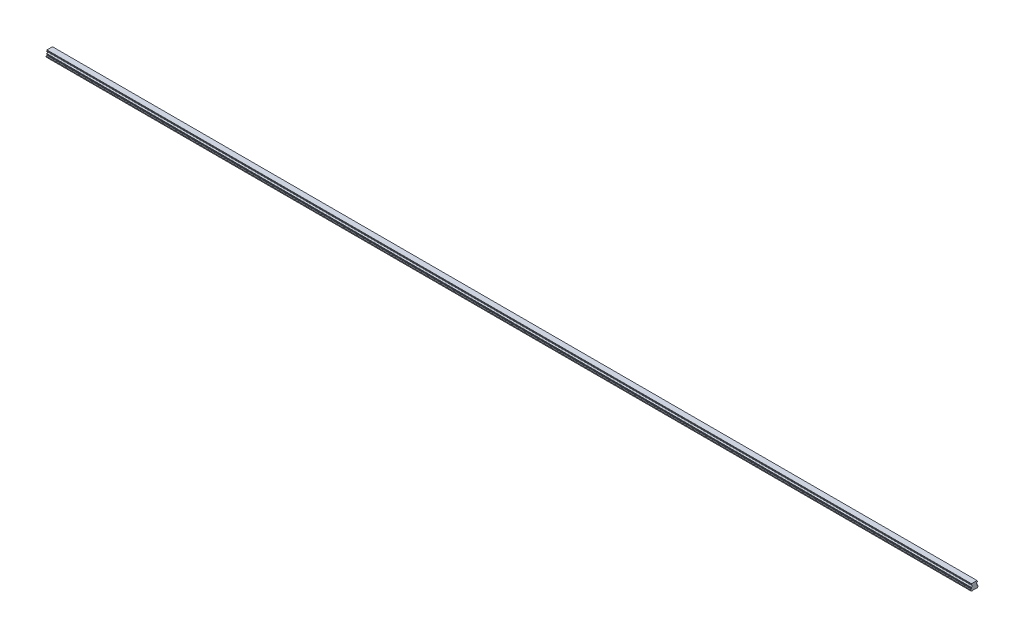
from build123d import *

# Parameters (mm, degrees)
BOSS_EXTRUDE1_DEPTH        = 3120
SKETCH3_R                  = 3
SKETCH3_R_2                = 2.5
CUT_EXTRUDE3_DEPTH         = 12
SKETCH3_2_R                = 2.5
CUT_EXTRUDE4_DEPTH         = 15
CHAMFER1_SIZE              = 0.5
LPATTERN4_COUNT            = 52
LPATTERN4_PITCH            = 60
CHAMFER1_OF_LPATTERN4_SIZE = 0.5


with BuildPart() as part:
    # Sketch1 → Boss-Extrude1 (new body)
    with BuildSketch(Plane(origin=(0, 0, 0), x_dir=(0, 0, -1), z_dir=(1, 0, 0))):
        with BuildLine():
            Line((9.375, 21.8), (-9.375, 21.8))
            Line((-9.375, 21.8), (-9.375, 20.756))
            Line((-9.375, 20.756), (-10, 19.415683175))
            Line((-10, 19.415683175), (-10, 17.685449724))
            ThreePointArc((-10, 17.685449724), (-7.2, 14.6), (-10, 11.514550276))
            Line((-10, 11.514550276), (-10, 9.784316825))
            Line((-10, 9.784316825), (-9.375, 8.444))
            Line((-9.375, 8.444), (-9.922688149, 6.4))
            Line((-9.922688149, 6.4), (-12.5, 5.489338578))
            Line((-12.5, 5.489338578), (-12.5, 2.65))
            Line((-12.5, 2.65), (-9.85, 0))
            Line((-9.85, 0), (-5.5, 0))
            Line((-5.5, 0), (-5, 0.5))
            Line((-5, 0.5), (5, 0.5))
            Line((5, 0.5), (5.5, 0))
            Line((5.5, 0), (9.85, 0))
            Line((9.85, 0), (12.5, 2.65))
            Line((12.5, 2.65), (12.5, 5.489338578))
            Line((12.5, 5.489338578), (9.922688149, 6.4))
            Line((9.922688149, 6.4), (9.375, 8.444))
            Line((9.375, 8.444), (10, 9.784316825))
            Line((10, 9.784316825), (10, 11.514550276))
            ThreePointArc((10, 11.514550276), (7.2, 14.6), (10, 17.685449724))
            Line((10, 17.685449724), (10, 19.415683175))
            Line((10, 19.415683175), (9.375, 20.756))
            Line((9.375, 20.756), (9.375, 21.8))
        make_face()
    extrude(amount=BOSS_EXTRUDE1_DEPTH)

    # Sketch3 → Cut-Extrude3 (cut)
    with BuildSketch(Plane.XZ):
        with Locations(Location((30, 0, 0), (0, 0, 270))):
            Circle(SKETCH3_R)
        with Locations(Location((30, 0, 0), (0, 0, 270))):
            Circle(SKETCH3_R_2, mode=Mode.SUBTRACT)
    cut_extrude3 = extrude(amount=-CUT_EXTRUDE3_DEPTH, mode=Mode.SUBTRACT)

    # Sketch3_2 → Cut-Extrude4 (cut)
    with BuildSketch(Plane.XZ):
        with Locations(Location((30, 0, 0), (0, 0, 270))):
            Circle(SKETCH3_2_R)
    cut_extrude4 = extrude(amount=-CUT_EXTRUDE4_DEPTH, mode=Mode.SUBTRACT)

    # Cut-Extrude5 cone 1 section (on through the dimple's axis) → Cut-Extrude5 (revolve, cut)
    with BuildSketch(Plane(origin=(30, 15, 0), x_dir=(0, 0, -1), z_dir=(1, 0, 0))):
        Polygon((0, 0), (2.5, 0), (0, 1.443375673), align=None)
    cut_extrude5 = revolve(axis=Axis((30, 15, 0), (0, 1, 0)), mode=Mode.SUBTRACT)

    # Chamfer1
    chamfer1_edges = [part.edges().sort_by_distance(p)[0] for p in [
        (30, 0.5, 3),
    ]]
    chamfer(chamfer1_edges, length=CHAMFER1_SIZE)

    # LPattern4: Cut-Extrude3, Cut-Extrude4, Cut-Extrude5 ×52
    with Locations(*[(i * LPATTERN4_PITCH, 0, 0) for i in range(1, LPATTERN4_COUNT)]):
        add(cut_extrude3, mode=Mode.SUBTRACT)
        add(cut_extrude4, mode=Mode.SUBTRACT)
        add(cut_extrude5, mode=Mode.SUBTRACT)

    # Chamfer1 of LPattern4
    chamfer1_of_lpattern4_edges = [part.edges().sort_by_distance(p)[0] for p in [
        (90, 0.5, 3),
        (150, 0.5, 3),
        (210, 0.5, 3),
        (270, 0.5, 3),
        (330, 0.5, 3),
        (390, 0.5, 3),
        (450, 0.5, 3),
        (510, 0.5, 3),
        (570, 0.5, 3),
        (630, 0.5, 3),
        (690, 0.5, 3),
        (750, 0.5, 3),
        (810, 0.5, 3),
        (870, 0.5, 3),
        (930, 0.5, 3),
        (990, 0.5, 3),
        (1050, 0.5, 3),
        (1110, 0.5, 3),
        (1170, 0.5, 3),
        (1230, 0.5, 3),
        (1290, 0.5, 3),
        (1350, 0.5, 3),
        (1410, 0.5, 3),
        (1470, 0.5, 3),
        (1530, 0.5, 3),
        (1590, 0.5, 3),
        (1650, 0.5, 3),
        (1710, 0.5, 3),
        (1770, 0.5, 3),
        (1830, 0.5, 3),
        (1890, 0.5, 3),
        (1950, 0.5, 3),
        (2010, 0.5, 3),
        (2070, 0.5, 3),
        (2130, 0.5, 3),
        (2190, 0.5, 3),
        (2250, 0.5, 3),
        (2310, 0.5, 3),
        (2370, 0.5, 3),
        (2430, 0.5, 3),
        (2490, 0.5, 3),
        (2550, 0.5, 3),
        (2610, 0.5, 3),
        (2670, 0.5, 3),
        (2730, 0.5, 3),
        (2790, 0.5, 3),
        (2850, 0.5, 3),
        (2910, 0.5, 3),
        (2970, 0.5, 3),
        (3030, 0.5, 3),
        (3090, 0.5, 3),
    ]]
    chamfer(chamfer1_of_lpattern4_edges, length=CHAMFER1_OF_LPATTERN4_SIZE)


solid = part.part
